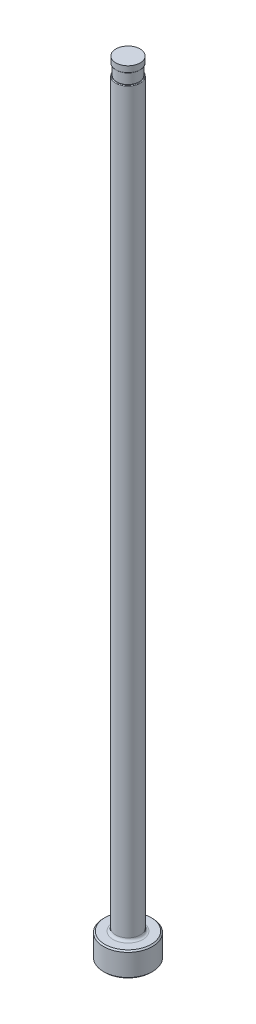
ISO-10303-21;
HEADER;
FILE_DESCRIPTION(('STEP AP214'),'2;1');
FILE_NAME('part.step','',(''),(''),'','','');
FILE_SCHEMA(('AUTOMOTIVE_DESIGN { 1 0 10303 214 1 1 1 1 }'));
ENDSEC;
DATA;
#1=APPLICATION_CONTEXT('core data for automotive mechanical design processes');
#2=APPLICATION_PROTOCOL_DEFINITION('international standard','automotive_design',2000,#1);
#3=PRODUCT_CONTEXT('',#1,'mechanical');
#4=PRODUCT('Part','Part','',(#3));
#5=PRODUCT_RELATED_PRODUCT_CATEGORY('part','',(#4));
#6=PRODUCT_DEFINITION_FORMATION('','',#4);
#7=PRODUCT_DEFINITION_CONTEXT('part definition',#1,'design');
#8=PRODUCT_DEFINITION('design','',#6,#7);
#9=PRODUCT_DEFINITION_SHAPE('','',#8);
#10=(LENGTH_UNIT() NAMED_UNIT(*) SI_UNIT(.MILLI.,.METRE.));
#11=(NAMED_UNIT(*) PLANE_ANGLE_UNIT() SI_UNIT($,.RADIAN.));
#12=(NAMED_UNIT(*) SI_UNIT($,.STERADIAN.) SOLID_ANGLE_UNIT());
#13=UNCERTAINTY_MEASURE_WITH_UNIT(LENGTH_MEASURE(1.E-05),#10,'distance_accuracy_value','');
#14=(GEOMETRIC_REPRESENTATION_CONTEXT(3) GLOBAL_UNCERTAINTY_ASSIGNED_CONTEXT((#13)) GLOBAL_UNIT_ASSIGNED_CONTEXT((#10,
#11,#12)) REPRESENTATION_CONTEXT('',''));
#15=CARTESIAN_POINT('',(0.,0.,0.));
#16=DIRECTION('',(0.,0.,1.));
#17=DIRECTION('',(1.,0.,0.));
#18=AXIS2_PLACEMENT_3D('',#15,#16,#17);
#19=CARTESIAN_POINT('',(-2.38124999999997,151.13,0.));
#20=DIRECTION('',(0.,1.,0.));
#21=DIRECTION('',(0.,0.,1.));
#22=AXIS2_PLACEMENT_3D('',#19,#20,#21);
#23=PLANE('',#22);
#24=CARTESIAN_POINT('',(0.,151.13,0.));
#25=DIRECTION('',(0.,1.,0.));
#26=DIRECTION('',(0.,0.,1.));
#27=AXIS2_PLACEMENT_3D('',#24,#25,#26);
#28=CIRCLE('',#27,2.23519999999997);
#29=CARTESIAN_POINT('',(0.,151.13,2.23519999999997));
#30=VERTEX_POINT('',#29);
#31=EDGE_CURVE('E11',#30,#30,#28,.F.);
#32=ORIENTED_EDGE('',*,*,#31,.T.);
#33=EDGE_LOOP('',(#32));
#34=FACE_BOUND('',#33,.T.);
#35=CARTESIAN_POINT('',(0.,151.13,0.));
#36=DIRECTION('',(0.,1.,0.));
#37=DIRECTION('',(0.,0.,1.));
#38=AXIS2_PLACEMENT_3D('',#35,#36,#37);
#39=CIRCLE('',#38,2.17804999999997);
#40=CARTESIAN_POINT('',(0.,151.13,2.17804999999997));
#41=VERTEX_POINT('',#40);
#42=EDGE_CURVE('E78',#41,#41,#39,.T.);
#43=ORIENTED_EDGE('',*,*,#42,.T.);
#44=EDGE_LOOP('',(#43));
#45=FACE_BOUND('',#44,.T.);
#46=ADVANCED_FACE('F36',(#34,#45),#23,.F.);
#47=CARTESIAN_POINT('',(0.,259.958771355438,0.));
#48=DIRECTION('',(0.,1.,0.));
#49=DIRECTION('',(0.,0.,1.));
#50=AXIS2_PLACEMENT_3D('',#47,#48,#49);
#51=CYLINDRICAL_SURFACE('',#50,2.38124999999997);
#52=DIRECTION('',(0.,1.,0.));
#53=VECTOR('',#52,1.);
#54=CARTESIAN_POINT('',(-2.17804999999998,259.958771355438,-0.962522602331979));
#55=LINE('',#54,#53);
#56=CARTESIAN_POINT('',(-2.17804999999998,148.971,-0.962522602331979));
#57=VERTEX_POINT('',#56);
#58=CARTESIAN_POINT('',(-2.17804999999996,86.614,-0.962522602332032));
#59=VERTEX_POINT('',#58);
#60=EDGE_CURVE('E73',#57,#59,#55,.F.);
#61=ORIENTED_EDGE('',*,*,#60,.F.);
#62=CARTESIAN_POINT('',(0.,148.971,0.));
#63=DIRECTION('',(0.,-1.,0.));
#64=DIRECTION('',(0.,0.,-1.));
#65=AXIS2_PLACEMENT_3D('',#62,#63,#64);
#66=CIRCLE('',#65,2.38124999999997);
#67=CARTESIAN_POINT('',(-2.17804999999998,148.971,0.962522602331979));
#68=VERTEX_POINT('',#67);
#69=EDGE_CURVE('E51',#57,#68,#66,.T.);
#70=ORIENTED_EDGE('',*,*,#69,.T.);
#71=DIRECTION('',(0.,1.,0.));
#72=VECTOR('',#71,1.);
#73=CARTESIAN_POINT('',(-2.17804999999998,259.958771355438,0.962522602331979));
#74=LINE('',#73,#72);
#75=CARTESIAN_POINT('',(-2.17804999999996,86.614,0.962522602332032));
#76=VERTEX_POINT('',#75);
#77=EDGE_CURVE('E84',#76,#68,#74,.T.);
#78=ORIENTED_EDGE('',*,*,#77,.F.);
#79=CARTESIAN_POINT('',(-2.17804999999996,86.614,-0.962522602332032));
#80=CARTESIAN_POINT('',(-2.17804780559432,86.5795018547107,-0.962518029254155));
#81=CARTESIAN_POINT('',(-2.17861298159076,86.545018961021,-0.961249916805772));
#82=CARTESIAN_POINT('',(-2.18085247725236,86.4762686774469,-0.956161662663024));
#83=CARTESIAN_POINT('',(-2.18252711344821,86.4420013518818,-0.952340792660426));
#84=CARTESIAN_POINT('',(-2.1891933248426,86.3395683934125,-0.936973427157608));
#85=CARTESIAN_POINT('',(-2.19582685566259,86.2720398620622,-0.921521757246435));
#86=CARTESIAN_POINT('',(-2.21282724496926,86.1406839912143,-0.879915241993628));
#87=CARTESIAN_POINT('',(-2.22320261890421,86.0768654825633,-0.853735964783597));
#88=CARTESIAN_POINT('',(-2.24648169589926,85.955467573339,-0.790444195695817));
#89=CARTESIAN_POINT('',(-2.25938069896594,85.8978768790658,-0.753351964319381));
#90=CARTESIAN_POINT('',(-2.28491232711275,85.795635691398,-0.671716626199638));
#91=CARTESIAN_POINT('',(-2.29748627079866,85.7503240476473,-0.627987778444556));
#92=CARTESIAN_POINT('',(-2.32155764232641,85.6692931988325,-0.532115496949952));
#93=CARTESIAN_POINT('',(-2.33305607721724,85.6335649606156,-0.479980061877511));
#94=CARTESIAN_POINT('',(-2.35169958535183,85.5780195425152,-0.377071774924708));
#95=CARTESIAN_POINT('',(-2.35923505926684,85.5566414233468,-0.32721006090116));
#96=CARTESIAN_POINT('',(-2.37124673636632,85.5232228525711,-0.224104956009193));
#97=CARTESIAN_POINT('',(-2.37572523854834,85.5111753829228,-0.170864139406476));
#98=CARTESIAN_POINT('',(-2.38075337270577,85.4977017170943,-0.0686114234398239));
#99=CARTESIAN_POINT('',(-2.38166713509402,85.4952904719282,-0.0197447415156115));
#100=CARTESIAN_POINT('',(-2.38048039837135,85.4984469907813,0.0776854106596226));
#101=CARTESIAN_POINT('',(-2.37838078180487,85.5040124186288,0.126248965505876));
#102=CARTESIAN_POINT('',(-2.37150634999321,85.5226178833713,0.220133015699));
#103=CARTESIAN_POINT('',(-2.36681675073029,85.5354201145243,0.265507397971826));
#104=CARTESIAN_POINT('',(-2.35529269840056,85.5678782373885,0.353434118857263));
#105=CARTESIAN_POINT('',(-2.34845810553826,85.5875345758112,0.395986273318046));
#106=CARTESIAN_POINT('',(-2.33302551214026,85.6338518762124,0.478724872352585));
#107=CARTESIAN_POINT('',(-2.32437464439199,85.6607318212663,0.518778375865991));
#108=CARTESIAN_POINT('',(-2.30627307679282,85.720276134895,0.594104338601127));
#109=CARTESIAN_POINT('',(-2.29682214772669,85.7529421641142,0.629375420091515));
#110=CARTESIAN_POINT('',(-2.2770553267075,85.826313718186,0.697674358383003));
#111=CARTESIAN_POINT('',(-2.26673904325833,85.8674804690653,0.730205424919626));
#112=CARTESIAN_POINT('',(-2.24701006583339,85.9543579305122,0.788832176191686));
#113=CARTESIAN_POINT('',(-2.23759789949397,86.0000712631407,0.814924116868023));
#114=CARTESIAN_POINT('',(-2.2192874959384,86.1010502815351,0.863643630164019));
#115=CARTESIAN_POINT('',(-2.21061480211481,86.156785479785,0.885381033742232));
#116=CARTESIAN_POINT('',(-2.1960946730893,86.2711026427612,0.920807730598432));
#117=CARTESIAN_POINT('',(-2.19024759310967,86.3296849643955,0.934496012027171));
#118=CARTESIAN_POINT('',(-2.18339215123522,86.4261545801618,0.950364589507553));
#119=CARTESIAN_POINT('',(-2.18139223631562,86.4636004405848,0.954933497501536));
#120=CARTESIAN_POINT('',(-2.17872026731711,86.5386947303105,0.961006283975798));
#121=CARTESIAN_POINT('',(-2.1780449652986,86.5763424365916,0.962517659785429));
#122=CARTESIAN_POINT('',(-2.17804999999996,86.614,0.962522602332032));
#123=B_SPLINE_CURVE_WITH_KNOTS('',3,(#79,#80,#81,#82,#83,#84,#85,#86,#87,#88,#89,#90,#91,#92,
#93,#94,#95,#96,#97,#98,#99,#100,#101,#102,#103,#104,#105,#106,#107,#108,#109,#110,#111,#112,
#113,#114,#115,#116,#117,#118,#119,#120,#121,#122),.UNSPECIFIED.,.F.,.F.,(4,2,2,2,2,2,2,2,2,2,2,
2,2,2,2,2,2,2,2,2,2,4),(0.,0.103435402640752,0.206900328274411,0.414624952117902,
0.622825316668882,0.830641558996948,1.02213180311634,1.21344091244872,1.37683606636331,
1.54010820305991,1.68618349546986,1.83221601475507,1.97370762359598,2.11520845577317,
2.26160909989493,2.40805183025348,2.56783060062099,2.72770205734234,2.90833881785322,
3.08899828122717,3.2021919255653,3.31510767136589),.UNSPECIFIED.);
#124=EDGE_CURVE('E81',#59,#76,#123,.T.);
#125=ORIENTED_EDGE('',*,*,#124,.F.);
#126=EDGE_LOOP('',(#61,#70,#78,#125));
#127=FACE_BOUND('',#126,.T.);
#128=CARTESIAN_POINT('',(0.,5.25779999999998,0.));
#129=DIRECTION('',(0.,1.,0.));
#130=DIRECTION('',(0.,0.,1.));
#131=AXIS2_PLACEMENT_3D('',#128,#129,#130);
#132=CIRCLE('',#131,2.38124999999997);
#133=CARTESIAN_POINT('',(0.,5.25779999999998,2.38124999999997));
#134=VERTEX_POINT('',#133);
#135=EDGE_CURVE('E116',#134,#134,#132,.T.);
#136=ORIENTED_EDGE('',*,*,#135,.T.);
#137=EDGE_LOOP('',(#136));
#138=FACE_BOUND('',#137,.T.);
#139=ADVANCED_FACE('F82',(#127,#138),#51,.T.);
#140=CARTESIAN_POINT('',(0.,0.,0.));
#141=DIRECTION('',(0.,-1.,0.));
#142=DIRECTION('',(0.,0.,-1.));
#143=AXIS2_PLACEMENT_3D('',#140,#141,#142);
#144=PLANE('',#143);
#145=CARTESIAN_POINT('',(0.,0.,0.));
#146=DIRECTION('',(0.,-1.,0.));
#147=DIRECTION('',(0.,0.,-1.));
#148=AXIS2_PLACEMENT_3D('',#145,#146,#147);
#149=CIRCLE('',#148,4.50849999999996);
#150=CARTESIAN_POINT('',(0.,0.,-4.50849999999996));
#151=VERTEX_POINT('',#150);
#152=EDGE_CURVE('E113',#151,#151,#149,.T.);
#153=ORIENTED_EDGE('',*,*,#152,.T.);
#154=EDGE_LOOP('',(#153));
#155=FACE_BOUND('',#154,.T.);
#156=ADVANCED_FACE('F192',(#155),#144,.T.);
#157=CARTESIAN_POINT('',(0.,259.958771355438,0.));
#158=DIRECTION('',(0.,1.,0.));
#159=DIRECTION('',(0.,0.,1.));
#160=AXIS2_PLACEMENT_3D('',#157,#158,#159);
#161=CYLINDRICAL_SURFACE('',#160,4.76249999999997);
#162=CARTESIAN_POINT('',(0.,4.49579999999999,0.));
#163=DIRECTION('',(0.,1.,0.));
#164=DIRECTION('',(0.,0.,1.));
#165=AXIS2_PLACEMENT_3D('',#162,#163,#164);
#166=CIRCLE('',#165,4.76249999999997);
#167=CARTESIAN_POINT('',(0.,4.49579999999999,4.76249999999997));
#168=VERTEX_POINT('',#167);
#169=EDGE_CURVE('E110',#168,#168,#166,.F.);
#170=ORIENTED_EDGE('',*,*,#169,.T.);
#171=EDGE_LOOP('',(#170));
#172=FACE_BOUND('',#171,.T.);
#173=CARTESIAN_POINT('',(0.,0.254000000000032,0.));
#174=DIRECTION('',(0.,-1.,0.));
#175=DIRECTION('',(0.,0.,-1.));
#176=AXIS2_PLACEMENT_3D('',#173,#174,#175);
#177=CIRCLE('',#176,4.76249999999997);
#178=CARTESIAN_POINT('',(0.,0.254000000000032,-4.76249999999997));
#179=VERTEX_POINT('',#178);
#180=EDGE_CURVE('E107',#179,#179,#177,.F.);
#181=ORIENTED_EDGE('',*,*,#180,.T.);
#182=EDGE_LOOP('',(#181));
#183=FACE_BOUND('',#182,.T.);
#184=ADVANCED_FACE('F195',(#172,#183),#161,.T.);
#185=CARTESIAN_POINT('',(-4.76249999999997,4.7498,0.));
#186=DIRECTION('',(0.,1.,0.));
#187=DIRECTION('',(0.,0.,1.));
#188=AXIS2_PLACEMENT_3D('',#185,#186,#187);
#189=PLANE('',#188);
#190=CARTESIAN_POINT('',(0.,4.7498,0.));
#191=DIRECTION('',(0.,1.,0.));
#192=DIRECTION('',(0.,0.,1.));
#193=AXIS2_PLACEMENT_3D('',#190,#191,#192);
#194=CIRCLE('',#193,2.88924999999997);
#195=CARTESIAN_POINT('',(0.,4.7498,2.88924999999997));
#196=VERTEX_POINT('',#195);
#197=EDGE_CURVE('E87',#196,#196,#194,.F.);
#198=ORIENTED_EDGE('',*,*,#197,.T.);
#199=EDGE_LOOP('',(#198));
#200=FACE_BOUND('',#199,.T.);
#201=CARTESIAN_POINT('',(0.,4.7498,0.));
#202=DIRECTION('',(0.,1.,0.));
#203=DIRECTION('',(0.,0.,1.));
#204=AXIS2_PLACEMENT_3D('',#201,#202,#203);
#205=CIRCLE('',#204,4.50849999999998);
#206=CARTESIAN_POINT('',(0.,4.7498,4.50849999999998));
#207=VERTEX_POINT('',#206);
#208=EDGE_CURVE('E104',#207,#207,#205,.T.);
#209=ORIENTED_EDGE('',*,*,#208,.T.);
#210=EDGE_LOOP('',(#209));
#211=FACE_BOUND('',#210,.T.);
#212=ADVANCED_FACE('F190',(#200,#211),#189,.T.);
#213=CARTESIAN_POINT('',(0.,4.74980000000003,0.));
#214=DIRECTION('',(0.,-1.,0.));
#215=DIRECTION('',(0.,0.,-1.));
#216=AXIS2_PLACEMENT_3D('',#213,#214,#215);
#217=CONICAL_SURFACE('',#216,4.50849999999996,0.785398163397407);
#218=ORIENTED_EDGE('',*,*,#169,.F.);
#219=EDGE_LOOP('',(#218));
#220=FACE_BOUND('',#219,.T.);
#221=ORIENTED_EDGE('',*,*,#208,.F.);
#222=EDGE_LOOP('',(#221));
#223=FACE_BOUND('',#222,.T.);
#224=ADVANCED_FACE('F186',(#220,#223),#217,.T.);
#225=CARTESIAN_POINT('',(0.,0.254000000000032,0.));
#226=DIRECTION('',(0.,1.,0.));
#227=DIRECTION('',(0.,0.,1.));
#228=AXIS2_PLACEMENT_3D('',#225,#226,#227);
#229=CONICAL_SURFACE('',#228,4.76249999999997,0.785398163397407);
#230=ORIENTED_EDGE('',*,*,#152,.F.);
#231=EDGE_LOOP('',(#230));
#232=FACE_BOUND('',#231,.T.);
#233=ORIENTED_EDGE('',*,*,#180,.F.);
#234=EDGE_LOOP('',(#233));
#235=FACE_BOUND('',#234,.T.);
#236=ADVANCED_FACE('F182',(#232,#235),#229,.T.);
#237=CARTESIAN_POINT('',(0.,5.25779999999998,0.));
#238=DIRECTION('',(0.,1.,0.));
#239=DIRECTION('',(0.,0.,1.));
#240=AXIS2_PLACEMENT_3D('',#237,#238,#239);
#241=TOROIDAL_SURFACE('',#240,2.88924999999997,0.508);
#242=ORIENTED_EDGE('',*,*,#197,.F.);
#243=EDGE_LOOP('',(#242));
#244=FACE_BOUND('',#243,.T.);
#245=ORIENTED_EDGE('',*,*,#135,.F.);
#246=EDGE_LOOP('',(#245));
#247=FACE_BOUND('',#246,.T.);
#248=ADVANCED_FACE('F147',(#244,#247),#241,.F.);
#249=CARTESIAN_POINT('',(-2.38124999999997,149.098,0.));
#250=DIRECTION('',(0.,-1.,0.));
#251=DIRECTION('',(0.,0.,-1.));
#252=AXIS2_PLACEMENT_3D('',#249,#250,#251);
#253=PLANE('',#252);
#254=DIRECTION('',(0.,0.,1.));
#255=VECTOR('',#254,1.);
#256=CARTESIAN_POINT('',(-2.17804999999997,149.098,0.));
#257=LINE('',#256,#255);
#258=CARTESIAN_POINT('',(-2.17804999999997,149.098,0.));
#259=VERTEX_POINT('',#258);
#260=CARTESIAN_POINT('',(-2.17804999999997,149.098,0.581155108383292));
#261=VERTEX_POINT('',#260);
#262=EDGE_CURVE('E90',#259,#261,#257,.T.);
#263=ORIENTED_EDGE('',*,*,#262,.T.);
#264=CARTESIAN_POINT('',(0.,149.098,0.));
#265=DIRECTION('',(0.,-1.,0.));
#266=DIRECTION('',(0.,0.,-1.));
#267=AXIS2_PLACEMENT_3D('',#264,#265,#266);
#268=CIRCLE('',#267,2.25424999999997);
#269=CARTESIAN_POINT('',(-2.17804999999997,149.098,-0.581155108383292));
#270=VERTEX_POINT('',#269);
#271=EDGE_CURVE('E86',#261,#270,#268,.F.);
#272=ORIENTED_EDGE('',*,*,#271,.T.);
#273=EDGE_CURVE('E79',#270,#259,#257,.T.);
#274=ORIENTED_EDGE('',*,*,#273,.T.);
#275=CARTESIAN_POINT('',(0.,149.098,0.));
#276=DIRECTION('',(0.,1.,0.));
#277=DIRECTION('',(0.,0.,1.));
#278=AXIS2_PLACEMENT_3D('',#275,#276,#277);
#279=CIRCLE('',#278,2.17804999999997);
#280=EDGE_CURVE('E101',#259,#259,#279,.T.);
#281=ORIENTED_EDGE('',*,*,#280,.F.);
#282=EDGE_LOOP('',(#263,#272,#274,#281));
#283=FACE_BOUND('',#282,.T.);
#284=ADVANCED_FACE('F144',(#283),#253,.F.);
#285=CARTESIAN_POINT('',(0.,153.448281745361,0.));
#286=DIRECTION('',(0.,1.,0.));
#287=DIRECTION('',(0.,0.,1.));
#288=AXIS2_PLACEMENT_3D('',#285,#286,#287);
#289=CYLINDRICAL_SURFACE('',#288,2.17804999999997);
#290=ORIENTED_EDGE('',*,*,#42,.F.);
#291=EDGE_LOOP('',(#290));
#292=FACE_BOUND('',#291,.T.);
#293=ORIENTED_EDGE('',*,*,#280,.T.);
#294=EDGE_LOOP('',(#293));
#295=FACE_BOUND('',#294,.T.);
#296=ADVANCED_FACE('F141',(#292,#295),#289,.T.);
#297=CARTESIAN_POINT('',(-2.17804999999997,150.114,-4.76249999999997));
#298=DIRECTION('',(1.,0.,0.));
#299=DIRECTION('',(0.,1.,0.));
#300=AXIS2_PLACEMENT_3D('',#297,#298,#299);
#301=PLANE('',#300);
#302=ORIENTED_EDGE('',*,*,#273,.F.);
#303=CARTESIAN_POINT('',(-2.17804999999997,149.098,-0.581155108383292));
#304=CARTESIAN_POINT('',(-2.17804999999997,149.097983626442,-0.602476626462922));
#305=CARTESIAN_POINT('',(-2.17804999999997,149.097640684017,-0.623812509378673));
#306=CARTESIAN_POINT('',(-2.17804999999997,149.095977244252,-0.66657666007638));
#307=CARTESIAN_POINT('',(-2.17804999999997,149.094650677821,-0.688004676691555));
#308=CARTESIAN_POINT('',(-2.17804999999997,149.090700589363,-0.730611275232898));
#309=CARTESIAN_POINT('',(-2.17804999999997,149.088085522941,-0.751790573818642));
#310=CARTESIAN_POINT('',(-2.17804999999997,149.081057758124,-0.793813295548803));
#311=CARTESIAN_POINT('',(-2.17804999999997,149.07664941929,-0.814657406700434));
#312=CARTESIAN_POINT('',(-2.17804999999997,149.066237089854,-0.851716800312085));
#313=CARTESIAN_POINT('',(-2.17804999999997,149.060702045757,-0.868052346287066));
#314=CARTESIAN_POINT('',(-2.17804999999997,149.049132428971,-0.894514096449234));
#315=CARTESIAN_POINT('',(-2.17804999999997,149.043824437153,-0.9049545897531));
#316=CARTESIAN_POINT('',(-2.17804999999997,149.031415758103,-0.92469921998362));
#317=CARTESIAN_POINT('',(-2.17804999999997,149.02433515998,-0.934014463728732));
#318=CARTESIAN_POINT('',(-2.17804999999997,149.013229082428,-0.944592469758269));
#319=CARTESIAN_POINT('',(-2.17804999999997,149.010360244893,-0.9470514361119));
#320=CARTESIAN_POINT('',(-2.17804999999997,149.004314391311,-0.951571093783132));
#321=CARTESIAN_POINT('',(-2.17804999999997,149.001137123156,-0.953631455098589));
#322=CARTESIAN_POINT('',(-2.17804999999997,148.994434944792,-0.95723424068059));
#323=CARTESIAN_POINT('',(-2.17804999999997,148.990905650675,-0.958768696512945));
#324=CARTESIAN_POINT('',(-2.17804999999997,148.983614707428,-0.961099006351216));
#325=CARTESIAN_POINT('',(-2.17804999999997,148.979854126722,-0.961898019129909));
#326=CARTESIAN_POINT('',(-2.17804999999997,148.975218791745,-0.962356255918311));
#327=CARTESIAN_POINT('',(-2.17804999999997,148.974376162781,-0.962418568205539));
#328=CARTESIAN_POINT('',(-2.17804999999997,148.972689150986,-0.96250166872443));
#329=CARTESIAN_POINT('',(-2.17804999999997,148.971844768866,-0.962522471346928));
#330=CARTESIAN_POINT('',(-2.17804999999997,148.971,-0.962522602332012));
#331=B_SPLINE_CURVE_WITH_KNOTS('',3,(#303,#304,#305,#306,#307,#308,#309,#310,#311,#312,#313,
#314,#315,#316,#317,#318,#319,#320,#321,#322,#323,#324,#325,#326,#327,#328,#329,#330),
.UNSPECIFIED.,.F.,.F.,(4,2,2,2,2,2,2,2,2,2,2,2,2,4),(0.,0.063984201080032,0.12836651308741,
0.192331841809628,0.256142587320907,0.307700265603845,0.342760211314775,0.377439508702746,
0.388748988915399,0.400067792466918,0.411551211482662,0.422985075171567,0.4255192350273,
0.42805251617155),.UNSPECIFIED.);
#332=EDGE_CURVE('E59',#270,#57,#331,.T.);
#333=ORIENTED_EDGE('',*,*,#332,.T.);
#334=ORIENTED_EDGE('',*,*,#60,.T.);
#335=DIRECTION('',(0.,0.,1.));
#336=VECTOR('',#335,1.);
#337=CARTESIAN_POINT('',(-2.17804999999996,86.614,-4.76249999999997));
#338=LINE('',#337,#336);
#339=EDGE_CURVE('E77',#59,#76,#338,.T.);
#340=ORIENTED_EDGE('',*,*,#339,.T.);
#341=ORIENTED_EDGE('',*,*,#77,.T.);
#342=CARTESIAN_POINT('',(-2.17804999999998,148.971,0.962522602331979));
#343=CARTESIAN_POINT('',(-2.17804999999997,148.974186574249,0.962531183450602));
#344=CARTESIAN_POINT('',(-2.17804999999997,148.977361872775,0.962226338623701));
#345=CARTESIAN_POINT('',(-2.17804999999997,148.983573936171,0.961069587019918));
#346=CARTESIAN_POINT('',(-2.17804999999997,148.986611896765,0.960224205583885));
#347=CARTESIAN_POINT('',(-2.17804999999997,148.993208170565,0.957808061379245));
#348=CARTESIAN_POINT('',(-2.17804999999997,148.996720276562,0.956113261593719));
#349=CARTESIAN_POINT('',(-2.17804999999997,149.003436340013,0.952177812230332));
#350=CARTESIAN_POINT('',(-2.17804999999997,149.006638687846,0.949934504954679));
#351=CARTESIAN_POINT('',(-2.17804999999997,149.014556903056,0.943588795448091));
#352=CARTESIAN_POINT('',(-2.17804999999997,149.019024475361,0.939179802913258));
#353=CARTESIAN_POINT('',(-2.17804999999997,149.027265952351,0.92976646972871));
#354=CARTESIAN_POINT('',(-2.17804999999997,149.031038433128,0.924760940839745));
#355=CARTESIAN_POINT('',(-2.17804999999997,149.041602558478,0.90908064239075));
#356=CARTESIAN_POINT('',(-2.17804999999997,149.047541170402,0.897838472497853));
#357=CARTESIAN_POINT('',(-2.17804999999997,149.057910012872,0.874691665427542));
#358=CARTESIAN_POINT('',(-2.17804999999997,149.062335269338,0.862784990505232));
#359=CARTESIAN_POINT('',(-2.17804999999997,149.072383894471,0.831512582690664));
#360=CARTESIAN_POINT('',(-2.17804999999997,149.077178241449,0.811883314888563));
#361=CARTESIAN_POINT('',(-2.17804999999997,149.08496264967,0.772260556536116));
#362=CARTESIAN_POINT('',(-2.17804999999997,149.08794845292,0.752266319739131));
#363=CARTESIAN_POINT('',(-2.17804999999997,149.094978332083,0.691996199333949));
#364=CARTESIAN_POINT('',(-2.17804999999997,149.097079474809,0.651494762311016));
#365=CARTESIAN_POINT('',(-2.17804999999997,149.097838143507,0.606044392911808));
#366=CARTESIAN_POINT('',(-2.17804999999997,149.097899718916,0.601059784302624));
#367=CARTESIAN_POINT('',(-2.17804999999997,149.097980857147,0.591102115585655));
#368=CARTESIAN_POINT('',(-2.17804999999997,149.098000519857,0.586129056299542));
#369=CARTESIAN_POINT('',(-2.17804999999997,149.098,0.581155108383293));
#370=B_SPLINE_CURVE_WITH_KNOTS('',3,(#342,#343,#344,#345,#346,#347,#348,#349,#350,#351,#352,
#353,#354,#355,#356,#357,#358,#359,#360,#361,#362,#363,#364,#365,#366,#367,#368,#369),
.UNSPECIFIED.,.F.,.F.,(4,2,2,2,2,2,2,2,2,2,2,2,2,4),(0.,0.00952696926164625,0.0189410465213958,
0.0305748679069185,0.042266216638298,0.0609902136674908,0.0797521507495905,0.117682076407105,
0.155735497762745,0.216197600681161,0.276801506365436,0.398198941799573,0.413154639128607,
0.428074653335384),.UNSPECIFIED.);
#371=EDGE_CURVE('E172',#68,#261,#370,.T.);
#372=ORIENTED_EDGE('',*,*,#371,.T.);
#373=ORIENTED_EDGE('',*,*,#262,.F.);
#374=EDGE_LOOP('',(#302,#333,#334,#340,#341,#372,#373));
#375=FACE_BOUND('',#374,.T.);
#376=ADVANCED_FACE('F75',(#375),#301,.F.);
#377=CARTESIAN_POINT('',(-5.35304999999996,86.614,-4.76249999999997));
#378=DIRECTION('',(0.,0.,1.));
#379=DIRECTION('',(1.,0.,0.));
#380=AXIS2_PLACEMENT_3D('',#377,#378,#379);
#381=CYLINDRICAL_SURFACE('',#380,3.175);
#382=ORIENTED_EDGE('',*,*,#339,.F.);
#383=ORIENTED_EDGE('',*,*,#124,.T.);
#384=EDGE_LOOP('',(#382,#383));
#385=FACE_BOUND('',#384,.T.);
#386=ADVANCED_FACE('F89',(#385),#381,.F.);
#387=CARTESIAN_POINT('',(0.,152.687735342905,0.));
#388=DIRECTION('',(0.,1.,0.));
#389=DIRECTION('',(0.,0.,1.));
#390=AXIS2_PLACEMENT_3D('',#387,#388,#389);
#391=CYLINDRICAL_SURFACE('',#390,2.36219999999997);
#392=CARTESIAN_POINT('',(0.,151.257,0.));
#393=DIRECTION('',(0.,1.,0.));
#394=DIRECTION('',(0.,0.,1.));
#395=AXIS2_PLACEMENT_3D('',#392,#393,#394);
#396=CIRCLE('',#395,2.36219999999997);
#397=CARTESIAN_POINT('',(0.,151.257,2.36219999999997));
#398=VERTEX_POINT('',#397);
#399=EDGE_CURVE('E44',#398,#398,#396,.T.);
#400=ORIENTED_EDGE('',*,*,#399,.T.);
#401=EDGE_LOOP('',(#400));
#402=FACE_BOUND('',#401,.T.);
#403=CARTESIAN_POINT('',(0.,152.4,0.));
#404=DIRECTION('',(0.,1.,0.));
#405=DIRECTION('',(0.,0.,1.));
#406=AXIS2_PLACEMENT_3D('',#403,#404,#405);
#407=CIRCLE('',#406,2.36219999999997);
#408=CARTESIAN_POINT('',(0.,152.4,2.36219999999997));
#409=VERTEX_POINT('',#408);
#410=EDGE_CURVE('E91',#409,#409,#407,.T.);
#411=ORIENTED_EDGE('',*,*,#410,.F.);
#412=EDGE_LOOP('',(#411));
#413=FACE_BOUND('',#412,.T.);
#414=ADVANCED_FACE('F135',(#402,#413),#391,.T.);
#415=CARTESIAN_POINT('',(-2.38124999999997,152.4,0.));
#416=DIRECTION('',(0.,1.,0.));
#417=DIRECTION('',(0.,0.,1.));
#418=AXIS2_PLACEMENT_3D('',#415,#416,#417);
#419=PLANE('',#418);
#420=ORIENTED_EDGE('',*,*,#410,.T.);
#421=EDGE_LOOP('',(#420));
#422=FACE_BOUND('',#421,.T.);
#423=ADVANCED_FACE('F149',(#422),#419,.T.);
#424=CARTESIAN_POINT('',(0.,148.971,0.));
#425=DIRECTION('',(0.,-1.,0.));
#426=DIRECTION('',(0.,0.,-1.));
#427=AXIS2_PLACEMENT_3D('',#424,#425,#426);
#428=TOROIDAL_SURFACE('',#427,2.25424999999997,0.127);
#429=ORIENTED_EDGE('',*,*,#371,.F.);
#430=ORIENTED_EDGE('',*,*,#69,.F.);
#431=ORIENTED_EDGE('',*,*,#332,.F.);
#432=ORIENTED_EDGE('',*,*,#271,.F.);
#433=EDGE_LOOP('',(#429,#430,#431,#432));
#434=FACE_BOUND('',#433,.T.);
#435=ADVANCED_FACE('F151',(#434),#428,.T.);
#436=CARTESIAN_POINT('',(0.,151.257,0.));
#437=DIRECTION('',(0.,1.,0.));
#438=DIRECTION('',(0.,0.,1.));
#439=AXIS2_PLACEMENT_3D('',#436,#437,#438);
#440=TOROIDAL_SURFACE('',#439,2.23519999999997,0.127);
#441=ORIENTED_EDGE('',*,*,#31,.F.);
#442=EDGE_LOOP('',(#441));
#443=FACE_BOUND('',#442,.T.);
#444=ORIENTED_EDGE('',*,*,#399,.F.);
#445=EDGE_LOOP('',(#444));
#446=FACE_BOUND('',#445,.T.);
#447=ADVANCED_FACE('F38',(#443,#446),#440,.T.);
#448=CLOSED_SHELL('',(#46,#139,#156,#184,#212,#224,#236,#248,#284,#296,#376,#386,#414,#423,#435,#447));
#449=MANIFOLD_SOLID_BREP('B2',#448);
#450=ADVANCED_BREP_SHAPE_REPRESENTATION('',(#18,#449),#14);
#451=SHAPE_DEFINITION_REPRESENTATION(#9,#450);
ENDSEC;
END-ISO-10303-21;
